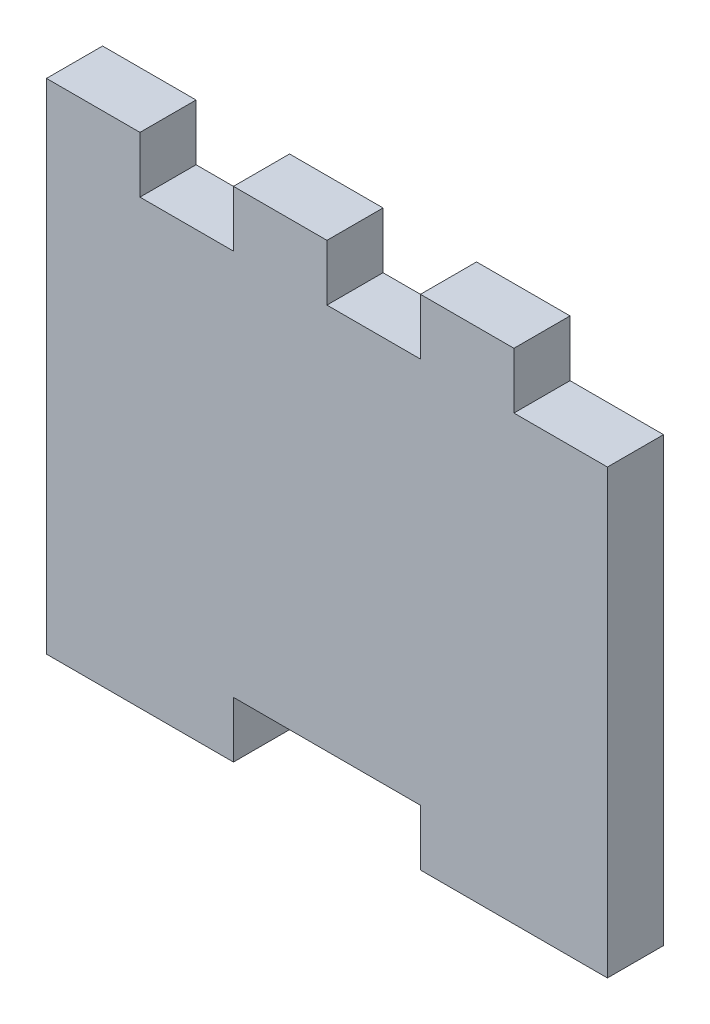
from build123d import *

# Parameters (mm, degrees)
EXTRUDE_1_DEPTH = 9


with BuildPart() as part:
    # Sketch 1 → Extrude 1 (new body)
    with BuildSketch(Plane.XY):
        Polygon((-141.621289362, 98.525967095), (-141.621289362, 178.525967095), (-126.621289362, 178.525967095), (-126.621289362, 169.525967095), (-111.621289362, 169.525967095), (-111.621289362, 178.525967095), (-96.621289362, 178.525967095), (-96.621289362, 169.525967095), (-81.621289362, 169.525967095), (-81.621289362, 178.525967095), (-66.621289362, 178.525967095), (-66.621289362, 169.525967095), (-51.621289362, 169.525967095), (-51.621289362, 98.525967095), (-81.621289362, 98.525967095), (-81.621289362, 107.525967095), (-111.621289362, 107.525967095), (-111.621289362, 98.525967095), align=None)
    extrude(amount=EXTRUDE_1_DEPTH)


solid = part.part
